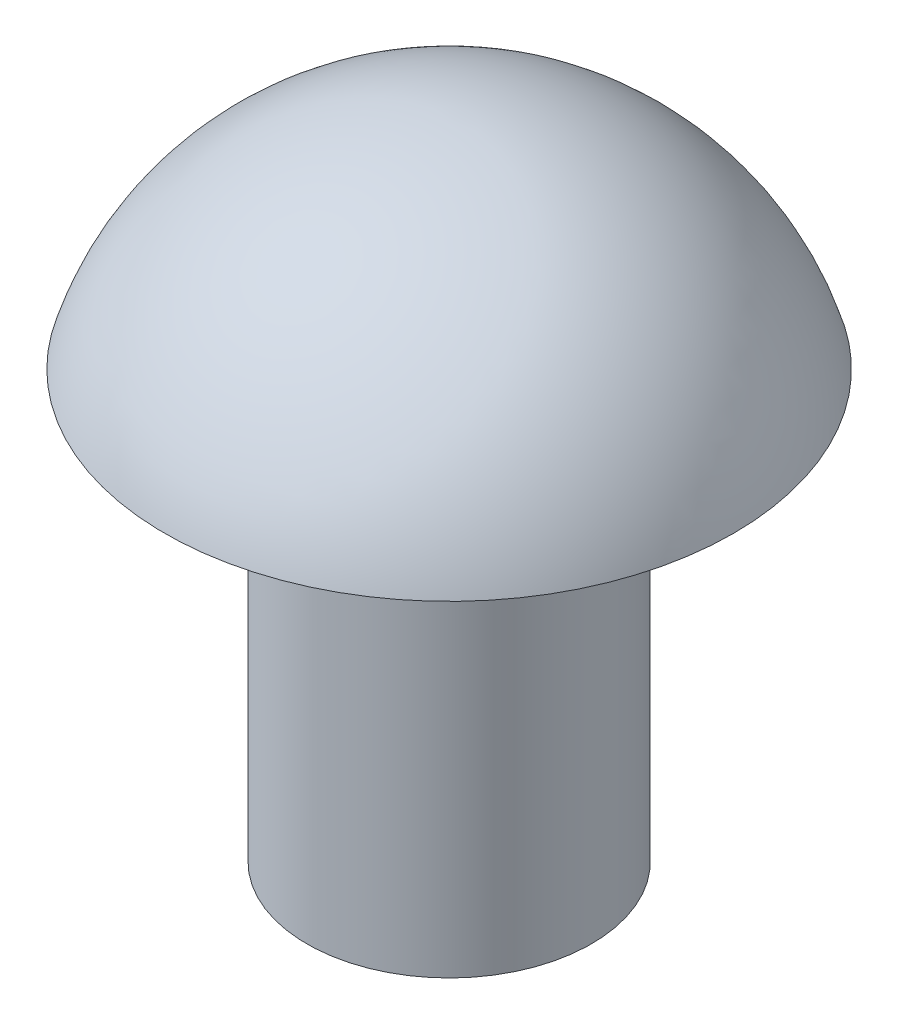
from build123d import *


with BuildPart() as part:
    # Esquisse1 → Base-R_volution (revolve)
    with BuildSketch(Plane.XY, mode=Mode.PRIVATE) as base_r_volution_sk:
        with BuildLine():
            Line((2, 3), (1, 3))
            Line((1, 3), (1, 0))
            Line((1, 0), (0, 0))
            Line((0, 0), (0, 4.5))
            ThreePointArc((0, 4.5), (1.25, 4.083333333), (2, 3))
        make_face()
    revolve(base_r_volution_sk.sketch.rotate(Axis((0, 0, 0), (0, 1, 0)), 90), axis=Axis((0, 0, 0), (0, 1, 0)))


solid = part.part
